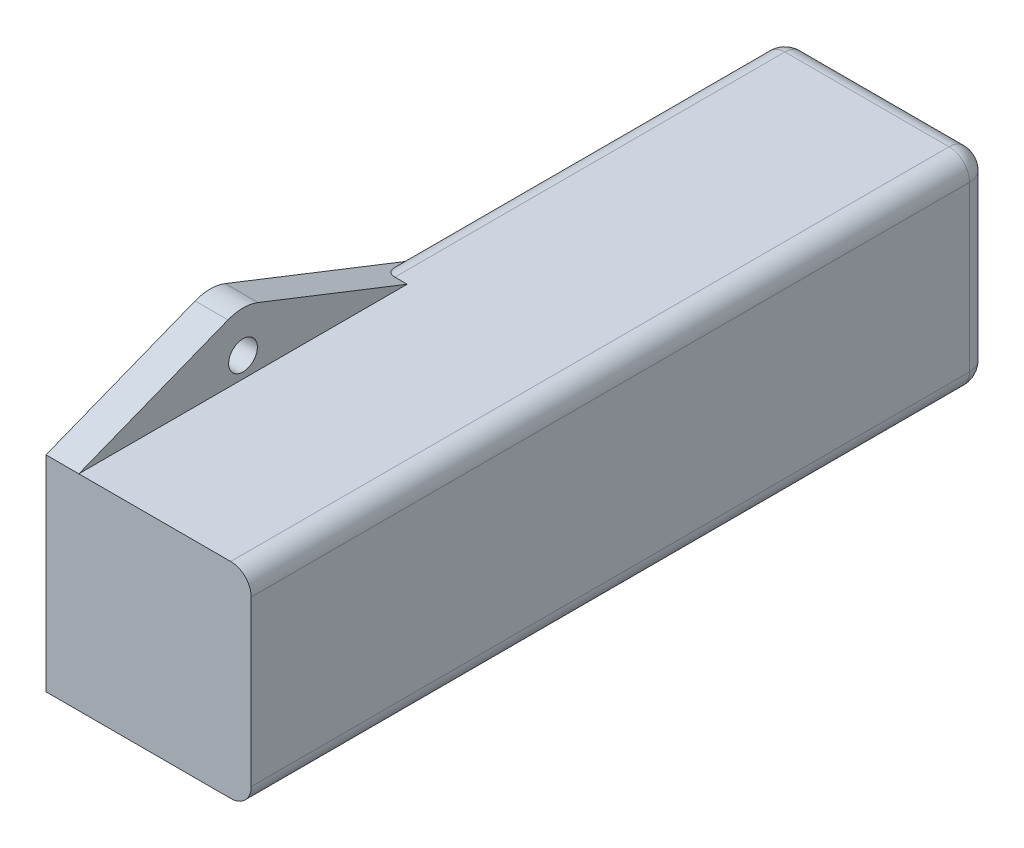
ISO-10303-21;
HEADER;
FILE_DESCRIPTION(('STEP AP214'),'2;1');
FILE_NAME('part.step','',(''),(''),'','','');
FILE_SCHEMA(('AUTOMOTIVE_DESIGN { 1 0 10303 214 1 1 1 1 }'));
ENDSEC;
DATA;
#1=APPLICATION_CONTEXT('core data for automotive mechanical design processes');
#2=APPLICATION_PROTOCOL_DEFINITION('international standard','automotive_design',2000,#1);
#3=PRODUCT_CONTEXT('',#1,'mechanical');
#4=PRODUCT('Part','Part','',(#3));
#5=PRODUCT_RELATED_PRODUCT_CATEGORY('part','',(#4));
#6=PRODUCT_DEFINITION_FORMATION('','',#4);
#7=PRODUCT_DEFINITION_CONTEXT('part definition',#1,'design');
#8=PRODUCT_DEFINITION('design','',#6,#7);
#9=PRODUCT_DEFINITION_SHAPE('','',#8);
#10=(LENGTH_UNIT() NAMED_UNIT(*) SI_UNIT(.MILLI.,.METRE.));
#11=(NAMED_UNIT(*) PLANE_ANGLE_UNIT() SI_UNIT($,.RADIAN.));
#12=(NAMED_UNIT(*) SI_UNIT($,.STERADIAN.) SOLID_ANGLE_UNIT());
#13=UNCERTAINTY_MEASURE_WITH_UNIT(LENGTH_MEASURE(1.E-05),#10,'distance_accuracy_value','');
#14=(GEOMETRIC_REPRESENTATION_CONTEXT(3) GLOBAL_UNCERTAINTY_ASSIGNED_CONTEXT((#13)) GLOBAL_UNIT_ASSIGNED_CONTEXT((#10,
#11,#12)) REPRESENTATION_CONTEXT('',''));
#15=CARTESIAN_POINT('',(0.,0.,0.));
#16=DIRECTION('',(0.,0.,1.));
#17=DIRECTION('',(1.,0.,0.));
#18=AXIS2_PLACEMENT_3D('',#15,#16,#17);
#19=CARTESIAN_POINT('',(25.,-12.5,45.));
#20=DIRECTION('',(0.,0.,-1.));
#21=DIRECTION('',(-1.,0.,0.));
#22=AXIS2_PLACEMENT_3D('',#19,#20,#21);
#23=PLANE('',#22);
#24=DIRECTION('',(-1.,0.,0.));
#25=VECTOR('',#24,1.);
#26=CARTESIAN_POINT('',(25.,-12.5,45.));
#27=LINE('',#26,#25);
#28=CARTESIAN_POINT('',(22.5,-12.5,45.));
#29=VERTEX_POINT('',#28);
#30=CARTESIAN_POINT('',(4.,-12.5,45.));
#31=VERTEX_POINT('',#30);
#32=EDGE_CURVE('E267',#29,#31,#27,.T.);
#33=ORIENTED_EDGE('',*,*,#32,.F.);
#34=CARTESIAN_POINT('',(22.5,-10.,45.));
#35=DIRECTION('',(0.,0.,-1.));
#36=DIRECTION('',(-1.,0.,0.));
#37=AXIS2_PLACEMENT_3D('',#34,#35,#36);
#38=CIRCLE('',#37,2.5);
#39=CARTESIAN_POINT('',(25.,-10.,45.));
#40=VERTEX_POINT('',#39);
#41=EDGE_CURVE('E325',#29,#40,#38,.F.);
#42=ORIENTED_EDGE('',*,*,#41,.T.);
#43=DIRECTION('',(0.,-1.,0.));
#44=VECTOR('',#43,1.);
#45=CARTESIAN_POINT('',(25.,-12.5,45.));
#46=LINE('',#45,#44);
#47=CARTESIAN_POINT('',(25.,10.,45.));
#48=VERTEX_POINT('',#47);
#49=EDGE_CURVE('E174',#48,#40,#46,.T.);
#50=ORIENTED_EDGE('',*,*,#49,.F.);
#51=CARTESIAN_POINT('',(22.5,10.,45.));
#52=DIRECTION('',(0.,0.,-1.));
#53=DIRECTION('',(-1.,0.,0.));
#54=AXIS2_PLACEMENT_3D('',#51,#52,#53);
#55=CIRCLE('',#54,2.5);
#56=CARTESIAN_POINT('',(22.5,12.5,45.));
#57=VERTEX_POINT('',#56);
#58=EDGE_CURVE('E322',#48,#57,#55,.F.);
#59=ORIENTED_EDGE('',*,*,#58,.T.);
#60=DIRECTION('',(-1.,0.,0.));
#61=VECTOR('',#60,1.);
#62=CARTESIAN_POINT('',(25.,12.5,45.));
#63=LINE('',#62,#61);
#64=CARTESIAN_POINT('',(4.,12.5,45.));
#65=VERTEX_POINT('',#64);
#66=EDGE_CURVE('E181',#57,#65,#63,.T.);
#67=ORIENTED_EDGE('',*,*,#66,.T.);
#68=DIRECTION('',(-1.,0.,0.));
#69=VECTOR('',#68,1.);
#70=CARTESIAN_POINT('',(4.,12.5,45.));
#71=LINE('',#70,#69);
#72=CARTESIAN_POINT('',(0.,12.5,45.));
#73=VERTEX_POINT('',#72);
#74=EDGE_CURVE('E178',#65,#73,#71,.T.);
#75=ORIENTED_EDGE('',*,*,#74,.T.);
#76=DIRECTION('',(0.,-1.,0.));
#77=VECTOR('',#76,1.);
#78=CARTESIAN_POINT('',(0.,-12.5,45.));
#79=LINE('',#78,#77);
#80=CARTESIAN_POINT('',(0.,-12.5,45.));
#81=VERTEX_POINT('',#80);
#82=EDGE_CURVE('E160',#73,#81,#79,.T.);
#83=ORIENTED_EDGE('',*,*,#82,.T.);
#84=DIRECTION('',(-1.,0.,0.));
#85=VECTOR('',#84,1.);
#86=CARTESIAN_POINT('',(4.,-12.5,45.));
#87=LINE('',#86,#85);
#88=EDGE_CURVE('E238',#31,#81,#87,.T.);
#89=ORIENTED_EDGE('',*,*,#88,.F.);
#90=EDGE_LOOP('',(#33,#42,#50,#59,#67,#75,#83,#89));
#91=FACE_BOUND('',#90,.T.);
#92=ADVANCED_FACE('F42',(#91),#23,.F.);
#93=CARTESIAN_POINT('',(25.,-12.5,45.));
#94=DIRECTION('',(0.,1.,0.));
#95=DIRECTION('',(0.,0.,1.));
#96=AXIS2_PLACEMENT_3D('',#93,#94,#95);
#97=PLANE('',#96);
#98=DIRECTION('',(-1.,0.,0.));
#99=VECTOR('',#98,1.);
#100=CARTESIAN_POINT('',(4.,-12.5,5.));
#101=LINE('',#100,#99);
#102=CARTESIAN_POINT('',(4.,-12.5,5.));
#103=VERTEX_POINT('',#102);
#104=CARTESIAN_POINT('',(2.5,-12.5,4.99999999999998));
#105=VERTEX_POINT('',#104);
#106=EDGE_CURVE('E246',#103,#105,#101,.T.);
#107=ORIENTED_EDGE('',*,*,#106,.T.);
#108=DIRECTION('',(0.,0.,-1.));
#109=VECTOR('',#108,1.);
#110=CARTESIAN_POINT('',(2.5,-12.5,-45.));
#111=LINE('',#110,#109);
#112=CARTESIAN_POINT('',(2.5,-12.5,-42.5));
#113=VERTEX_POINT('',#112);
#114=EDGE_CURVE('E293',#105,#113,#111,.T.);
#115=ORIENTED_EDGE('',*,*,#114,.T.);
#116=DIRECTION('',(-1.,0.,0.));
#117=VECTOR('',#116,1.);
#118=CARTESIAN_POINT('',(25.,-12.5,-42.5));
#119=LINE('',#118,#117);
#120=CARTESIAN_POINT('',(22.5,-12.5,-42.5));
#121=VERTEX_POINT('',#120);
#122=EDGE_CURVE('E289',#113,#121,#119,.F.);
#123=ORIENTED_EDGE('',*,*,#122,.T.);
#124=DIRECTION('',(0.,0.,-1.));
#125=VECTOR('',#124,1.);
#126=CARTESIAN_POINT('',(22.5,-12.5,45.));
#127=LINE('',#126,#125);
#128=EDGE_CURVE('E286',#121,#29,#127,.F.);
#129=ORIENTED_EDGE('',*,*,#128,.T.);
#130=ORIENTED_EDGE('',*,*,#32,.T.);
#131=DIRECTION('',(0.,0.,1.));
#132=VECTOR('',#131,1.);
#133=CARTESIAN_POINT('',(4.,-12.5,45.));
#134=LINE('',#133,#132);
#135=EDGE_CURVE('E175',#103,#31,#134,.T.);
#136=ORIENTED_EDGE('',*,*,#135,.F.);
#137=EDGE_LOOP('',(#107,#115,#123,#129,#130,#136));
#138=FACE_BOUND('',#137,.T.);
#139=ADVANCED_FACE('F336',(#138),#97,.F.);
#140=CARTESIAN_POINT('',(25.,-12.5,-45.));
#141=DIRECTION('',(0.,0.,1.));
#142=DIRECTION('',(1.,0.,0.));
#143=AXIS2_PLACEMENT_3D('',#140,#141,#142);
#144=PLANE('',#143);
#145=DIRECTION('',(0.,1.,0.));
#146=VECTOR('',#145,1.);
#147=CARTESIAN_POINT('',(22.5,-12.5,-45.));
#148=LINE('',#147,#146);
#149=CARTESIAN_POINT('',(22.5,10.,-45.));
#150=VERTEX_POINT('',#149);
#151=CARTESIAN_POINT('',(22.5,-10.,-45.));
#152=VERTEX_POINT('',#151);
#153=EDGE_CURVE('E279',#150,#152,#148,.F.);
#154=ORIENTED_EDGE('',*,*,#153,.T.);
#155=DIRECTION('',(-1.,0.,0.));
#156=VECTOR('',#155,1.);
#157=CARTESIAN_POINT('',(25.,-10.,-45.));
#158=LINE('',#157,#156);
#159=CARTESIAN_POINT('',(2.5,-10.,-45.));
#160=VERTEX_POINT('',#159);
#161=EDGE_CURVE('E282',#152,#160,#158,.T.);
#162=ORIENTED_EDGE('',*,*,#161,.T.);
#163=DIRECTION('',(0.,1.,0.));
#164=VECTOR('',#163,1.);
#165=CARTESIAN_POINT('',(2.5,12.5,-45.));
#166=LINE('',#165,#164);
#167=CARTESIAN_POINT('',(2.5,10.,-45.));
#168=VERTEX_POINT('',#167);
#169=EDGE_CURVE('E273',#160,#168,#166,.T.);
#170=ORIENTED_EDGE('',*,*,#169,.T.);
#171=DIRECTION('',(-1.,0.,0.));
#172=VECTOR('',#171,1.);
#173=CARTESIAN_POINT('',(25.,10.,-45.));
#174=LINE('',#173,#172);
#175=EDGE_CURVE('E276',#168,#150,#174,.F.);
#176=ORIENTED_EDGE('',*,*,#175,.T.);
#177=EDGE_LOOP('',(#154,#162,#170,#176));
#178=FACE_BOUND('',#177,.T.);
#179=ADVANCED_FACE('F434',(#178),#144,.F.);
#180=CARTESIAN_POINT('',(25.,12.5,45.));
#181=DIRECTION('',(0.,-1.,0.));
#182=DIRECTION('',(0.,0.,-1.));
#183=AXIS2_PLACEMENT_3D('',#180,#181,#182);
#184=PLANE('',#183);
#185=DIRECTION('',(-1.,0.,0.));
#186=VECTOR('',#185,1.);
#187=CARTESIAN_POINT('',(25.,12.5,-42.5));
#188=LINE('',#187,#186);
#189=CARTESIAN_POINT('',(22.5,12.5,-42.5));
#190=VERTEX_POINT('',#189);
#191=CARTESIAN_POINT('',(2.5,12.5,-42.5));
#192=VERTEX_POINT('',#191);
#193=EDGE_CURVE('E308',#190,#192,#188,.T.);
#194=ORIENTED_EDGE('',*,*,#193,.T.);
#195=DIRECTION('',(0.,0.,1.));
#196=VECTOR('',#195,1.);
#197=CARTESIAN_POINT('',(2.5,12.5,5.00000000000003));
#198=LINE('',#197,#196);
#199=CARTESIAN_POINT('',(2.5,12.5,5.));
#200=VERTEX_POINT('',#199);
#201=EDGE_CURVE('E311',#192,#200,#198,.T.);
#202=ORIENTED_EDGE('',*,*,#201,.T.);
#203=DIRECTION('',(-1.,0.,0.));
#204=VECTOR('',#203,1.);
#205=CARTESIAN_POINT('',(4.,12.5,5.));
#206=LINE('',#205,#204);
#207=CARTESIAN_POINT('',(4.,12.5,5.));
#208=VERTEX_POINT('',#207);
#209=EDGE_CURVE('E250',#208,#200,#206,.T.);
#210=ORIENTED_EDGE('',*,*,#209,.F.);
#211=DIRECTION('',(0.,0.,-1.));
#212=VECTOR('',#211,1.);
#213=CARTESIAN_POINT('',(4.,12.5,45.));
#214=LINE('',#213,#212);
#215=EDGE_CURVE('E270',#65,#208,#214,.T.);
#216=ORIENTED_EDGE('',*,*,#215,.F.);
#217=ORIENTED_EDGE('',*,*,#66,.F.);
#218=DIRECTION('',(0.,0.,1.));
#219=VECTOR('',#218,1.);
#220=CARTESIAN_POINT('',(22.5,12.5,45.));
#221=LINE('',#220,#219);
#222=EDGE_CURVE('E305',#57,#190,#221,.F.);
#223=ORIENTED_EDGE('',*,*,#222,.T.);
#224=EDGE_LOOP('',(#194,#202,#210,#216,#217,#223));
#225=FACE_BOUND('',#224,.T.);
#226=ADVANCED_FACE('F438',(#225),#184,.F.);
#227=CARTESIAN_POINT('',(25.,-12.5,45.));
#228=DIRECTION('',(-1.,0.,0.));
#229=DIRECTION('',(0.,0.,1.));
#230=AXIS2_PLACEMENT_3D('',#227,#228,#229);
#231=PLANE('',#230);
#232=ORIENTED_EDGE('',*,*,#49,.T.);
#233=DIRECTION('',(0.,0.,-1.));
#234=VECTOR('',#233,1.);
#235=CARTESIAN_POINT('',(25.,-10.,45.));
#236=LINE('',#235,#234);
#237=CARTESIAN_POINT('',(25.,-10.,-42.5));
#238=VERTEX_POINT('',#237);
#239=EDGE_CURVE('E302',#40,#238,#236,.T.);
#240=ORIENTED_EDGE('',*,*,#239,.T.);
#241=DIRECTION('',(0.,1.,0.));
#242=VECTOR('',#241,1.);
#243=CARTESIAN_POINT('',(25.,-12.5,-42.5));
#244=LINE('',#243,#242);
#245=CARTESIAN_POINT('',(25.,10.,-42.5));
#246=VERTEX_POINT('',#245);
#247=EDGE_CURVE('E299',#238,#246,#244,.T.);
#248=ORIENTED_EDGE('',*,*,#247,.T.);
#249=DIRECTION('',(0.,0.,1.));
#250=VECTOR('',#249,1.);
#251=CARTESIAN_POINT('',(25.,10.,45.));
#252=LINE('',#251,#250);
#253=EDGE_CURVE('E296',#246,#48,#252,.T.);
#254=ORIENTED_EDGE('',*,*,#253,.T.);
#255=EDGE_LOOP('',(#232,#240,#248,#254));
#256=FACE_BOUND('',#255,.T.);
#257=ADVANCED_FACE('F410',(#256),#231,.F.);
#258=CARTESIAN_POINT('',(0.,-12.5,45.));
#259=DIRECTION('',(-1.,0.,0.));
#260=DIRECTION('',(0.,0.,1.));
#261=AXIS2_PLACEMENT_3D('',#258,#259,#260);
#262=PLANE('',#261);
#263=DIRECTION('',(0.,0.,-1.));
#264=VECTOR('',#263,1.);
#265=CARTESIAN_POINT('',(0.,-10.,5.));
#266=LINE('',#265,#264);
#267=CARTESIAN_POINT('',(0.,-10.,-42.5));
#268=VERTEX_POINT('',#267);
#269=CARTESIAN_POINT('',(0.,-10.,-1.3504161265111));
#270=VERTEX_POINT('',#269);
#271=EDGE_CURVE('E319',#268,#270,#266,.F.);
#272=ORIENTED_EDGE('',*,*,#271,.T.);
#273=DIRECTION('',(0.,-0.366311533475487,0.930492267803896));
#274=VECTOR('',#273,1.);
#275=CARTESIAN_POINT('',(0.,-12.5,5.));
#276=LINE('',#275,#274);
#277=CARTESIAN_POINT('',(0.,-19.6524613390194,23.1684423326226));
#278=VERTEX_POINT('',#277);
#279=EDGE_CURVE('E57',#270,#278,#276,.T.);
#280=ORIENTED_EDGE('',*,*,#279,.T.);
#281=CARTESIAN_POINT('',(0.,-15.,25.));
#282=DIRECTION('',(-1.,0.,0.));
#283=DIRECTION('',(0.,0.,1.));
#284=AXIS2_PLACEMENT_3D('',#281,#282,#283);
#285=CIRCLE('',#284,5.);
#286=CARTESIAN_POINT('',(0.,-19.6524613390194,26.8315576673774));
#287=VERTEX_POINT('',#286);
#288=EDGE_CURVE('E211',#278,#287,#285,.T.);
#289=ORIENTED_EDGE('',*,*,#288,.T.);
#290=DIRECTION('',(0.,0.366311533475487,0.930492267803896));
#291=VECTOR('',#290,1.);
#292=CARTESIAN_POINT('',(0.,-19.6524613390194,26.8315576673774));
#293=LINE('',#292,#291);
#294=EDGE_CURVE('E169',#287,#81,#293,.T.);
#295=ORIENTED_EDGE('',*,*,#294,.T.);
#296=ORIENTED_EDGE('',*,*,#82,.F.);
#297=DIRECTION('',(0.,0.366311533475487,-0.930492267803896));
#298=VECTOR('',#297,1.);
#299=CARTESIAN_POINT('',(0.,19.6524613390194,26.8315576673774));
#300=LINE('',#299,#298);
#301=CARTESIAN_POINT('',(0.,19.6524613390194,26.8315576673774));
#302=VERTEX_POINT('',#301);
#303=EDGE_CURVE('E166',#73,#302,#300,.T.);
#304=ORIENTED_EDGE('',*,*,#303,.T.);
#305=CARTESIAN_POINT('',(0.,14.9999999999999,25.));
#306=DIRECTION('',(-1.,0.,0.));
#307=DIRECTION('',(0.,0.,-1.));
#308=AXIS2_PLACEMENT_3D('',#305,#306,#307);
#309=CIRCLE('',#308,5.);
#310=CARTESIAN_POINT('',(0.,19.6524613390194,23.1684423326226));
#311=VERTEX_POINT('',#310);
#312=EDGE_CURVE('E193',#302,#311,#309,.T.);
#313=ORIENTED_EDGE('',*,*,#312,.T.);
#314=DIRECTION('',(0.,-0.366311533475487,-0.930492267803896));
#315=VECTOR('',#314,1.);
#316=CARTESIAN_POINT('',(0.,12.5,4.99999999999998));
#317=LINE('',#316,#315);
#318=CARTESIAN_POINT('',(0.,10.,-1.35041612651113));
#319=VERTEX_POINT('',#318);
#320=EDGE_CURVE('E199',#311,#319,#317,.T.);
#321=ORIENTED_EDGE('',*,*,#320,.T.);
#322=DIRECTION('',(0.,0.,1.));
#323=VECTOR('',#322,1.);
#324=CARTESIAN_POINT('',(0.,10.,-45.));
#325=LINE('',#324,#323);
#326=CARTESIAN_POINT('',(0.,10.,-42.5));
#327=VERTEX_POINT('',#326);
#328=EDGE_CURVE('E314',#319,#327,#325,.F.);
#329=ORIENTED_EDGE('',*,*,#328,.T.);
#330=DIRECTION('',(0.,1.,0.));
#331=VECTOR('',#330,1.);
#332=CARTESIAN_POINT('',(0.,-12.5,-42.5));
#333=LINE('',#332,#331);
#334=EDGE_CURVE('E64',#327,#268,#333,.F.);
#335=ORIENTED_EDGE('',*,*,#334,.T.);
#336=EDGE_LOOP('',(#272,#280,#289,#295,#296,#304,#313,#321,#329,#335));
#337=FACE_BOUND('',#336,.T.);
#338=CARTESIAN_POINT('',(0.,14.9999999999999,25.));
#339=DIRECTION('',(-1.,0.,0.));
#340=DIRECTION('',(0.,0.,1.));
#341=AXIS2_PLACEMENT_3D('',#338,#339,#340);
#342=CIRCLE('',#341,1.75);
#343=CARTESIAN_POINT('',(0.,14.9999999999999,26.75));
#344=VERTEX_POINT('',#343);
#345=EDGE_CURVE('E203',#344,#344,#342,.T.);
#346=ORIENTED_EDGE('',*,*,#345,.F.);
#347=EDGE_LOOP('',(#346));
#348=FACE_BOUND('',#347,.T.);
#349=CARTESIAN_POINT('',(0.,-15.,25.));
#350=DIRECTION('',(-1.,0.,0.));
#351=DIRECTION('',(0.,0.,1.));
#352=AXIS2_PLACEMENT_3D('',#349,#350,#351);
#353=CIRCLE('',#352,1.75);
#354=CARTESIAN_POINT('',(0.,-15.,26.75));
#355=VERTEX_POINT('',#354);
#356=EDGE_CURVE('E395',#355,#355,#353,.T.);
#357=ORIENTED_EDGE('',*,*,#356,.F.);
#358=EDGE_LOOP('',(#357));
#359=FACE_BOUND('',#358,.T.);
#360=ADVANCED_FACE('F162',(#337,#348,#359),#262,.T.);
#361=CARTESIAN_POINT('',(4.,14.9999999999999,25.));
#362=DIRECTION('',(-1.,0.,0.));
#363=DIRECTION('',(0.,0.,1.));
#364=AXIS2_PLACEMENT_3D('',#361,#362,#363);
#365=CYLINDRICAL_SURFACE('',#364,5.);
#366=ORIENTED_EDGE('',*,*,#312,.F.);
#367=DIRECTION('',(-1.,0.,0.));
#368=VECTOR('',#367,1.);
#369=CARTESIAN_POINT('',(4.,19.6524613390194,26.8315576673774));
#370=LINE('',#369,#368);
#371=CARTESIAN_POINT('',(4.,19.6524613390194,26.8315576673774));
#372=VERTEX_POINT('',#371);
#373=EDGE_CURVE('E187',#372,#302,#370,.T.);
#374=ORIENTED_EDGE('',*,*,#373,.F.);
#375=CARTESIAN_POINT('',(4.,14.9999999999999,25.));
#376=DIRECTION('',(-1.,0.,0.));
#377=DIRECTION('',(0.,0.,-1.));
#378=AXIS2_PLACEMENT_3D('',#375,#376,#377);
#379=CIRCLE('',#378,5.);
#380=CARTESIAN_POINT('',(4.,19.6524613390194,23.1684423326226));
#381=VERTEX_POINT('',#380);
#382=EDGE_CURVE('E219',#372,#381,#379,.T.);
#383=ORIENTED_EDGE('',*,*,#382,.T.);
#384=DIRECTION('',(-1.,0.,0.));
#385=VECTOR('',#384,1.);
#386=CARTESIAN_POINT('',(4.,19.6524613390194,23.1684423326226));
#387=LINE('',#386,#385);
#388=EDGE_CURVE('E254',#381,#311,#387,.T.);
#389=ORIENTED_EDGE('',*,*,#388,.T.);
#390=EDGE_LOOP('',(#366,#374,#383,#389));
#391=FACE_BOUND('',#390,.T.);
#392=ADVANCED_FACE('F409',(#391),#365,.T.);
#393=CARTESIAN_POINT('',(4.,14.9999999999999,25.));
#394=DIRECTION('',(-1.,0.,0.));
#395=DIRECTION('',(0.,0.,1.));
#396=AXIS2_PLACEMENT_3D('',#393,#394,#395);
#397=CYLINDRICAL_SURFACE('',#396,1.75);
#398=CARTESIAN_POINT('',(4.,14.9999999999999,25.));
#399=DIRECTION('',(-1.,0.,0.));
#400=DIRECTION('',(0.,0.,1.));
#401=AXIS2_PLACEMENT_3D('',#398,#399,#400);
#402=CIRCLE('',#401,1.75);
#403=CARTESIAN_POINT('',(4.,14.9999999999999,26.75));
#404=VERTEX_POINT('',#403);
#405=EDGE_CURVE('E194',#404,#404,#402,.T.);
#406=ORIENTED_EDGE('',*,*,#405,.F.);
#407=EDGE_LOOP('',(#406));
#408=FACE_BOUND('',#407,.T.);
#409=ORIENTED_EDGE('',*,*,#345,.T.);
#410=EDGE_LOOP('',(#409));
#411=FACE_BOUND('',#410,.T.);
#412=ADVANCED_FACE('F406',(#408,#411),#397,.F.);
#413=CARTESIAN_POINT('',(4.,-15.,25.));
#414=DIRECTION('',(-1.,0.,0.));
#415=DIRECTION('',(0.,0.,1.));
#416=AXIS2_PLACEMENT_3D('',#413,#414,#415);
#417=PLANE('',#416);
#418=ORIENTED_EDGE('',*,*,#405,.T.);
#419=EDGE_LOOP('',(#418));
#420=FACE_BOUND('',#419,.T.);
#421=DIRECTION('',(0.,0.366311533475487,-0.930492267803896));
#422=VECTOR('',#421,1.);
#423=CARTESIAN_POINT('',(4.,19.6524613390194,26.8315576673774));
#424=LINE('',#423,#422);
#425=EDGE_CURVE('E216',#65,#372,#424,.T.);
#426=ORIENTED_EDGE('',*,*,#425,.F.);
#427=ORIENTED_EDGE('',*,*,#215,.T.);
#428=DIRECTION('',(0.,-0.366311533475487,-0.930492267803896));
#429=VECTOR('',#428,1.);
#430=CARTESIAN_POINT('',(4.,12.5,5.));
#431=LINE('',#430,#429);
#432=EDGE_CURVE('E223',#381,#208,#431,.T.);
#433=ORIENTED_EDGE('',*,*,#432,.F.);
#434=ORIENTED_EDGE('',*,*,#382,.F.);
#435=EDGE_LOOP('',(#426,#427,#433,#434));
#436=FACE_BOUND('',#435,.T.);
#437=ADVANCED_FACE('F451',(#420,#436),#417,.F.);
#438=CARTESIAN_POINT('',(4.,19.6524613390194,26.8315576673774));
#439=DIRECTION('',(0.,0.930492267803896,0.366311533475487));
#440=DIRECTION('',(0.,-0.366311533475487,0.930492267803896));
#441=AXIS2_PLACEMENT_3D('',#438,#439,#440);
#442=PLANE('',#441);
#443=ORIENTED_EDGE('',*,*,#303,.F.);
#444=ORIENTED_EDGE('',*,*,#74,.F.);
#445=ORIENTED_EDGE('',*,*,#425,.T.);
#446=ORIENTED_EDGE('',*,*,#373,.T.);
#447=EDGE_LOOP('',(#443,#444,#445,#446));
#448=FACE_BOUND('',#447,.T.);
#449=ADVANCED_FACE('F190',(#448),#442,.T.);
#450=CARTESIAN_POINT('',(4.,12.5,5.));
#451=DIRECTION('',(0.,0.930492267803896,-0.366311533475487));
#452=DIRECTION('',(0.,0.366311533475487,0.930492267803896));
#453=AXIS2_PLACEMENT_3D('',#450,#451,#452);
#454=PLANE('',#453);
#455=ORIENTED_EDGE('',*,*,#320,.F.);
#456=ORIENTED_EDGE('',*,*,#388,.F.);
#457=ORIENTED_EDGE('',*,*,#432,.T.);
#458=ORIENTED_EDGE('',*,*,#209,.T.);
#459=CARTESIAN_POINT('',(2.5,10.,-1.3504161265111));
#460=DIRECTION('',(0.,0.930492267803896,-0.366311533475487));
#461=DIRECTION('',(0.,-0.366311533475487,-0.930492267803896));
#462=AXIS2_PLACEMENT_3D('',#459,#460,#461);
#463=ELLIPSE('',#462,6.82479193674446,2.5);
#464=EDGE_CURVE('E11',#200,#319,#463,.F.);
#465=ORIENTED_EDGE('',*,*,#464,.T.);
#466=EDGE_LOOP('',(#455,#456,#457,#458,#465));
#467=FACE_BOUND('',#466,.T.);
#468=ADVANCED_FACE('F450',(#467),#454,.T.);
#469=CARTESIAN_POINT('',(4.,-15.,25.));
#470=DIRECTION('',(-1.,0.,0.));
#471=DIRECTION('',(0.,0.,1.));
#472=AXIS2_PLACEMENT_3D('',#469,#470,#471);
#473=CIRCLE('',#472,1.75);
#474=CARTESIAN_POINT('',(4.,-15.,26.75));
#475=VERTEX_POINT('',#474);
#476=EDGE_CURVE('E399',#475,#475,#473,.T.);
#477=ORIENTED_EDGE('',*,*,#476,.T.);
#478=EDGE_LOOP('',(#477));
#479=FACE_BOUND('',#478,.T.);
#480=DIRECTION('',(0.,-0.366311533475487,0.930492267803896));
#481=VECTOR('',#480,1.);
#482=CARTESIAN_POINT('',(4.,-12.5,5.));
#483=LINE('',#482,#481);
#484=CARTESIAN_POINT('',(4.,-19.6524613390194,23.1684423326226));
#485=VERTEX_POINT('',#484);
#486=EDGE_CURVE('E227',#103,#485,#483,.T.);
#487=ORIENTED_EDGE('',*,*,#486,.F.);
#488=ORIENTED_EDGE('',*,*,#135,.T.);
#489=DIRECTION('',(0.,0.366311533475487,0.930492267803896));
#490=VECTOR('',#489,1.);
#491=CARTESIAN_POINT('',(4.,-19.6524613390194,26.8315576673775));
#492=LINE('',#491,#490);
#493=CARTESIAN_POINT('',(4.,-19.6524613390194,26.8315576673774));
#494=VERTEX_POINT('',#493);
#495=EDGE_CURVE('E188',#494,#31,#492,.T.);
#496=ORIENTED_EDGE('',*,*,#495,.F.);
#497=CARTESIAN_POINT('',(4.,-15.,25.));
#498=DIRECTION('',(-1.,0.,0.));
#499=DIRECTION('',(0.,0.,1.));
#500=AXIS2_PLACEMENT_3D('',#497,#498,#499);
#501=CIRCLE('',#500,5.);
#502=EDGE_CURVE('E231',#485,#494,#501,.T.);
#503=ORIENTED_EDGE('',*,*,#502,.F.);
#504=EDGE_LOOP('',(#487,#488,#496,#503));
#505=FACE_BOUND('',#504,.T.);
#506=ADVANCED_FACE('F456',(#479,#505),#417,.F.);
#507=CARTESIAN_POINT('',(4.,-19.6524613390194,26.8315576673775));
#508=DIRECTION('',(0.,-0.930492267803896,0.366311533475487));
#509=DIRECTION('',(0.,-0.366311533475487,-0.930492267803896));
#510=AXIS2_PLACEMENT_3D('',#507,#508,#509);
#511=PLANE('',#510);
#512=ORIENTED_EDGE('',*,*,#294,.F.);
#513=DIRECTION('',(-1.,0.,0.));
#514=VECTOR('',#513,1.);
#515=CARTESIAN_POINT('',(4.,-19.6524613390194,26.8315576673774));
#516=LINE('',#515,#514);
#517=EDGE_CURVE('E241',#494,#287,#516,.T.);
#518=ORIENTED_EDGE('',*,*,#517,.F.);
#519=ORIENTED_EDGE('',*,*,#495,.T.);
#520=ORIENTED_EDGE('',*,*,#88,.T.);
#521=EDGE_LOOP('',(#512,#518,#519,#520));
#522=FACE_BOUND('',#521,.T.);
#523=ADVANCED_FACE('F461',(#522),#511,.T.);
#524=CARTESIAN_POINT('',(4.,-15.,25.));
#525=DIRECTION('',(-1.,0.,0.));
#526=DIRECTION('',(0.,0.,1.));
#527=AXIS2_PLACEMENT_3D('',#524,#525,#526);
#528=CYLINDRICAL_SURFACE('',#527,5.);
#529=ORIENTED_EDGE('',*,*,#288,.F.);
#530=DIRECTION('',(-1.,0.,0.));
#531=VECTOR('',#530,1.);
#532=CARTESIAN_POINT('',(4.,-19.6524613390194,23.1684423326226));
#533=LINE('',#532,#531);
#534=EDGE_CURVE('E243',#485,#278,#533,.T.);
#535=ORIENTED_EDGE('',*,*,#534,.F.);
#536=ORIENTED_EDGE('',*,*,#502,.T.);
#537=ORIENTED_EDGE('',*,*,#517,.T.);
#538=EDGE_LOOP('',(#529,#535,#536,#537));
#539=FACE_BOUND('',#538,.T.);
#540=ADVANCED_FACE('F426',(#539),#528,.T.);
#541=CARTESIAN_POINT('',(4.,-12.5,5.));
#542=DIRECTION('',(0.,-0.930492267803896,-0.366311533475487));
#543=DIRECTION('',(0.,0.366311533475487,-0.930492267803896));
#544=AXIS2_PLACEMENT_3D('',#541,#542,#543);
#545=PLANE('',#544);
#546=ORIENTED_EDGE('',*,*,#279,.F.);
#547=CARTESIAN_POINT('',(2.5,-10.,-1.35041612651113));
#548=DIRECTION('',(0.,-0.930492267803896,-0.366311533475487));
#549=DIRECTION('',(0.,-0.366311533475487,0.930492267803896));
#550=AXIS2_PLACEMENT_3D('',#547,#548,#549);
#551=ELLIPSE('',#550,6.82479193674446,2.5);
#552=EDGE_CURVE('E50',#270,#105,#551,.F.);
#553=ORIENTED_EDGE('',*,*,#552,.T.);
#554=ORIENTED_EDGE('',*,*,#106,.F.);
#555=ORIENTED_EDGE('',*,*,#486,.T.);
#556=ORIENTED_EDGE('',*,*,#534,.T.);
#557=EDGE_LOOP('',(#546,#553,#554,#555,#556));
#558=FACE_BOUND('',#557,.T.);
#559=ADVANCED_FACE('F331',(#558),#545,.T.);
#560=CARTESIAN_POINT('',(4.,-15.,25.));
#561=DIRECTION('',(-1.,0.,0.));
#562=DIRECTION('',(0.,0.,1.));
#563=AXIS2_PLACEMENT_3D('',#560,#561,#562);
#564=CYLINDRICAL_SURFACE('',#563,1.75);
#565=ORIENTED_EDGE('',*,*,#476,.F.);
#566=EDGE_LOOP('',(#565));
#567=FACE_BOUND('',#566,.T.);
#568=ORIENTED_EDGE('',*,*,#356,.T.);
#569=EDGE_LOOP('',(#568));
#570=FACE_BOUND('',#569,.T.);
#571=ADVANCED_FACE('F414',(#567,#570),#564,.F.);
#572=CARTESIAN_POINT('',(22.5,10.,45.));
#573=DIRECTION('',(0.,0.,1.));
#574=DIRECTION('',(0.,-1.,0.));
#575=AXIS2_PLACEMENT_3D('',#572,#573,#574);
#576=CYLINDRICAL_SURFACE('',#575,2.5);
#577=ORIENTED_EDGE('',*,*,#58,.F.);
#578=ORIENTED_EDGE('',*,*,#253,.F.);
#579=CARTESIAN_POINT('',(22.5,10.,-42.5));
#580=DIRECTION('',(0.,0.,-1.));
#581=DIRECTION('',(-1.,0.,0.));
#582=AXIS2_PLACEMENT_3D('',#579,#580,#581);
#583=CIRCLE('',#582,2.5);
#584=EDGE_CURVE('E391',#190,#246,#583,.T.);
#585=ORIENTED_EDGE('',*,*,#584,.F.);
#586=ORIENTED_EDGE('',*,*,#222,.F.);
#587=EDGE_LOOP('',(#577,#578,#585,#586));
#588=FACE_BOUND('',#587,.T.);
#589=ADVANCED_FACE('F416',(#588),#576,.T.);
#590=CARTESIAN_POINT('',(25.,10.,-42.5));
#591=DIRECTION('',(-1.,0.,0.));
#592=DIRECTION('',(0.,0.,1.));
#593=AXIS2_PLACEMENT_3D('',#590,#591,#592);
#594=CYLINDRICAL_SURFACE('',#593,2.5);
#595=CARTESIAN_POINT('',(2.5,10.,-42.5));
#596=DIRECTION('',(-1.,0.,0.));
#597=DIRECTION('',(0.,0.,1.));
#598=AXIS2_PLACEMENT_3D('',#595,#596,#597);
#599=CIRCLE('',#598,2.5);
#600=EDGE_CURVE('E383',#192,#168,#599,.T.);
#601=ORIENTED_EDGE('',*,*,#600,.F.);
#602=ORIENTED_EDGE('',*,*,#193,.F.);
#603=CARTESIAN_POINT('',(22.5,10.,-42.5));
#604=DIRECTION('',(1.,0.,0.));
#605=DIRECTION('',(0.,0.,-1.));
#606=AXIS2_PLACEMENT_3D('',#603,#604,#605);
#607=CIRCLE('',#606,2.5);
#608=EDGE_CURVE('E387',#150,#190,#607,.T.);
#609=ORIENTED_EDGE('',*,*,#608,.F.);
#610=ORIENTED_EDGE('',*,*,#175,.F.);
#611=EDGE_LOOP('',(#601,#602,#609,#610));
#612=FACE_BOUND('',#611,.T.);
#613=ADVANCED_FACE('F423',(#612),#594,.T.);
#614=CARTESIAN_POINT('',(2.5,10.,45.));
#615=DIRECTION('',(0.,0.,-1.));
#616=DIRECTION('',(0.,1.,0.));
#617=AXIS2_PLACEMENT_3D('',#614,#615,#616);
#618=CYLINDRICAL_SURFACE('',#617,2.5);
#619=ORIENTED_EDGE('',*,*,#464,.F.);
#620=ORIENTED_EDGE('',*,*,#201,.F.);
#621=CARTESIAN_POINT('',(2.5,10.,-42.5));
#622=DIRECTION('',(0.,0.,-1.));
#623=DIRECTION('',(-1.,0.,0.));
#624=AXIS2_PLACEMENT_3D('',#621,#622,#623);
#625=CIRCLE('',#624,2.5);
#626=EDGE_CURVE('E379',#327,#192,#625,.T.);
#627=ORIENTED_EDGE('',*,*,#626,.F.);
#628=ORIENTED_EDGE('',*,*,#328,.F.);
#629=EDGE_LOOP('',(#619,#620,#627,#628));
#630=FACE_BOUND('',#629,.T.);
#631=ADVANCED_FACE('F484',(#630),#618,.T.);
#632=CARTESIAN_POINT('',(22.5,10.,-42.5));
#633=DIRECTION('',(0.,0.,1.));
#634=DIRECTION('',(1.,0.,0.));
#635=AXIS2_PLACEMENT_3D('',#632,#633,#634);
#636=SPHERICAL_SURFACE('',#635,2.5);
#637=ORIENTED_EDGE('',*,*,#608,.T.);
#638=ORIENTED_EDGE('',*,*,#584,.T.);
#639=CARTESIAN_POINT('',(22.5,10.,-42.5));
#640=DIRECTION('',(0.,1.,0.));
#641=DIRECTION('',(0.,0.,1.));
#642=AXIS2_PLACEMENT_3D('',#639,#640,#641);
#643=CIRCLE('',#642,2.5);
#644=EDGE_CURVE('E375',#150,#246,#643,.F.);
#645=ORIENTED_EDGE('',*,*,#644,.F.);
#646=EDGE_LOOP('',(#637,#638,#645));
#647=FACE_BOUND('',#646,.T.);
#648=ADVANCED_FACE('F517',(#647),#636,.T.);
#649=CARTESIAN_POINT('',(2.5,10.,-42.5));
#650=DIRECTION('',(0.,0.,1.));
#651=DIRECTION('',(1.,0.,0.));
#652=AXIS2_PLACEMENT_3D('',#649,#650,#651);
#653=SPHERICAL_SURFACE('',#652,2.5);
#654=ORIENTED_EDGE('',*,*,#626,.T.);
#655=ORIENTED_EDGE('',*,*,#600,.T.);
#656=CARTESIAN_POINT('',(2.5,10.,-42.5));
#657=DIRECTION('',(0.,1.,0.));
#658=DIRECTION('',(0.,0.,1.));
#659=AXIS2_PLACEMENT_3D('',#656,#657,#658);
#660=CIRCLE('',#659,2.5);
#661=EDGE_CURVE('E371',#327,#168,#660,.F.);
#662=ORIENTED_EDGE('',*,*,#661,.F.);
#663=EDGE_LOOP('',(#654,#655,#662));
#664=FACE_BOUND('',#663,.T.);
#665=ADVANCED_FACE('F488',(#664),#653,.T.);
#666=CARTESIAN_POINT('',(22.5,-10.,45.));
#667=DIRECTION('',(0.,0.,-1.));
#668=DIRECTION('',(-1.,0.,0.));
#669=AXIS2_PLACEMENT_3D('',#666,#667,#668);
#670=CYLINDRICAL_SURFACE('',#669,2.5);
#671=ORIENTED_EDGE('',*,*,#41,.F.);
#672=ORIENTED_EDGE('',*,*,#128,.F.);
#673=CARTESIAN_POINT('',(22.5,-10.,-42.5));
#674=DIRECTION('',(0.,0.,-1.));
#675=DIRECTION('',(-1.,0.,0.));
#676=AXIS2_PLACEMENT_3D('',#673,#674,#675);
#677=CIRCLE('',#676,2.5);
#678=EDGE_CURVE('E368',#238,#121,#677,.T.);
#679=ORIENTED_EDGE('',*,*,#678,.F.);
#680=ORIENTED_EDGE('',*,*,#239,.F.);
#681=EDGE_LOOP('',(#671,#672,#679,#680));
#682=FACE_BOUND('',#681,.T.);
#683=ADVANCED_FACE('F505',(#682),#670,.T.);
#684=CARTESIAN_POINT('',(22.5,-12.5,-42.5));
#685=DIRECTION('',(0.,1.,0.));
#686=DIRECTION('',(0.,0.,1.));
#687=AXIS2_PLACEMENT_3D('',#684,#685,#686);
#688=CYLINDRICAL_SURFACE('',#687,2.5);
#689=ORIENTED_EDGE('',*,*,#644,.T.);
#690=ORIENTED_EDGE('',*,*,#247,.F.);
#691=CARTESIAN_POINT('',(22.5,-10.,-42.5));
#692=DIRECTION('',(0.,-1.,0.));
#693=DIRECTION('',(0.,0.,-1.));
#694=AXIS2_PLACEMENT_3D('',#691,#692,#693);
#695=CIRCLE('',#694,2.5);
#696=EDGE_CURVE('E364',#152,#238,#695,.T.);
#697=ORIENTED_EDGE('',*,*,#696,.F.);
#698=ORIENTED_EDGE('',*,*,#153,.F.);
#699=EDGE_LOOP('',(#689,#690,#697,#698));
#700=FACE_BOUND('',#699,.T.);
#701=ADVANCED_FACE('F497',(#700),#688,.T.);
#702=CARTESIAN_POINT('',(2.5,-12.5,-42.5));
#703=DIRECTION('',(0.,-1.,0.));
#704=DIRECTION('',(0.,0.,-1.));
#705=AXIS2_PLACEMENT_3D('',#702,#703,#704);
#706=CYLINDRICAL_SURFACE('',#705,2.5);
#707=ORIENTED_EDGE('',*,*,#661,.T.);
#708=ORIENTED_EDGE('',*,*,#169,.F.);
#709=CARTESIAN_POINT('',(2.5,-10.,-42.5));
#710=DIRECTION('',(0.,-1.,0.));
#711=DIRECTION('',(0.,0.,-1.));
#712=AXIS2_PLACEMENT_3D('',#709,#710,#711);
#713=CIRCLE('',#712,2.5);
#714=EDGE_CURVE('E346',#268,#160,#713,.T.);
#715=ORIENTED_EDGE('',*,*,#714,.F.);
#716=ORIENTED_EDGE('',*,*,#334,.F.);
#717=EDGE_LOOP('',(#707,#708,#715,#716));
#718=FACE_BOUND('',#717,.T.);
#719=ADVANCED_FACE('F490',(#718),#706,.T.);
#720=CARTESIAN_POINT('',(2.5,-10.,45.));
#721=DIRECTION('',(0.,0.,1.));
#722=DIRECTION('',(1.,0.,0.));
#723=AXIS2_PLACEMENT_3D('',#720,#721,#722);
#724=CYLINDRICAL_SURFACE('',#723,2.5);
#725=ORIENTED_EDGE('',*,*,#552,.F.);
#726=ORIENTED_EDGE('',*,*,#271,.F.);
#727=CARTESIAN_POINT('',(2.5,-10.,-42.5));
#728=DIRECTION('',(0.,0.,-1.));
#729=DIRECTION('',(-1.,0.,0.));
#730=AXIS2_PLACEMENT_3D('',#727,#728,#729);
#731=CIRCLE('',#730,2.5);
#732=EDGE_CURVE('E340',#113,#268,#731,.T.);
#733=ORIENTED_EDGE('',*,*,#732,.F.);
#734=ORIENTED_EDGE('',*,*,#114,.F.);
#735=EDGE_LOOP('',(#725,#726,#733,#734));
#736=FACE_BOUND('',#735,.T.);
#737=ADVANCED_FACE('F338',(#736),#724,.T.);
#738=CARTESIAN_POINT('',(22.5,-10.,-42.5));
#739=DIRECTION('',(0.,0.,1.));
#740=DIRECTION('',(1.,0.,0.));
#741=AXIS2_PLACEMENT_3D('',#738,#739,#740);
#742=SPHERICAL_SURFACE('',#741,2.5);
#743=ORIENTED_EDGE('',*,*,#696,.T.);
#744=ORIENTED_EDGE('',*,*,#678,.T.);
#745=CARTESIAN_POINT('',(22.5,-10.,-42.5));
#746=DIRECTION('',(1.,0.,0.));
#747=DIRECTION('',(0.,0.,-1.));
#748=AXIS2_PLACEMENT_3D('',#745,#746,#747);
#749=CIRCLE('',#748,2.5);
#750=EDGE_CURVE('E347',#152,#121,#749,.F.);
#751=ORIENTED_EDGE('',*,*,#750,.F.);
#752=EDGE_LOOP('',(#743,#744,#751));
#753=FACE_BOUND('',#752,.T.);
#754=ADVANCED_FACE('F500',(#753),#742,.T.);
#755=CARTESIAN_POINT('',(2.5,-10.,-42.5));
#756=DIRECTION('',(0.,0.,1.));
#757=DIRECTION('',(1.,0.,0.));
#758=AXIS2_PLACEMENT_3D('',#755,#756,#757);
#759=SPHERICAL_SURFACE('',#758,2.5);
#760=ORIENTED_EDGE('',*,*,#732,.T.);
#761=ORIENTED_EDGE('',*,*,#714,.T.);
#762=CARTESIAN_POINT('',(2.5,-10.,-42.5));
#763=DIRECTION('',(-1.,0.,0.));
#764=DIRECTION('',(0.,0.,1.));
#765=AXIS2_PLACEMENT_3D('',#762,#763,#764);
#766=CIRCLE('',#765,2.5);
#767=EDGE_CURVE('E352',#113,#160,#766,.F.);
#768=ORIENTED_EDGE('',*,*,#767,.F.);
#769=EDGE_LOOP('',(#760,#761,#768));
#770=FACE_BOUND('',#769,.T.);
#771=ADVANCED_FACE('F355',(#770),#759,.T.);
#772=CARTESIAN_POINT('',(25.,-10.,-42.5));
#773=DIRECTION('',(-1.,0.,0.));
#774=DIRECTION('',(0.,0.,1.));
#775=AXIS2_PLACEMENT_3D('',#772,#773,#774);
#776=CYLINDRICAL_SURFACE('',#775,2.5);
#777=ORIENTED_EDGE('',*,*,#750,.T.);
#778=ORIENTED_EDGE('',*,*,#122,.F.);
#779=ORIENTED_EDGE('',*,*,#767,.T.);
#780=ORIENTED_EDGE('',*,*,#161,.F.);
#781=EDGE_LOOP('',(#777,#778,#779,#780));
#782=FACE_BOUND('',#781,.T.);
#783=ADVANCED_FACE('F350',(#782),#776,.T.);
#784=CLOSED_SHELL('',(#92,#139,#179,#226,#257,#360,#392,#412,#437,#449,#468,#506,#523,#540,#559,
#571,#589,#613,#631,#648,#665,#683,#701,#719,#737,#754,#771,#783));
#785=MANIFOLD_SOLID_BREP('B2',#784);
#786=ADVANCED_BREP_SHAPE_REPRESENTATION('',(#18,#785),#14);
#787=SHAPE_DEFINITION_REPRESENTATION(#9,#786);
ENDSEC;
END-ISO-10303-21;
